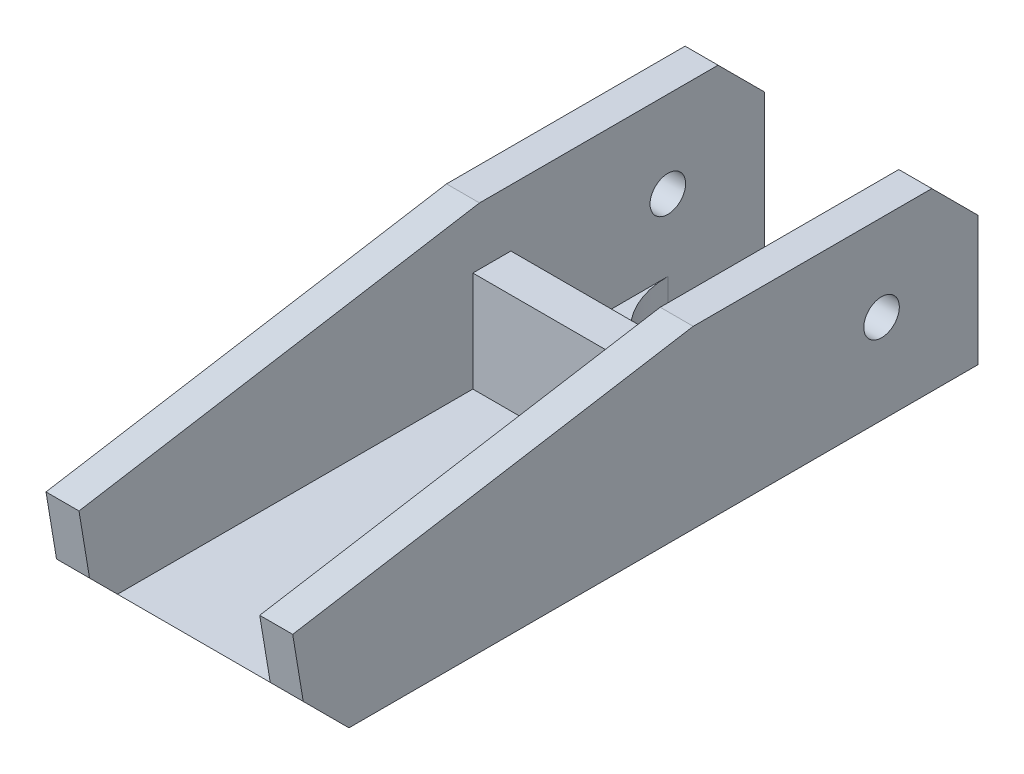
ISO-10303-21;
HEADER;
FILE_DESCRIPTION(('STEP AP214'),'2;1');
FILE_NAME('part.step','',(''),(''),'','','');
FILE_SCHEMA(('AUTOMOTIVE_DESIGN { 1 0 10303 214 1 1 1 1 }'));
ENDSEC;
DATA;
#1=APPLICATION_CONTEXT('core data for automotive mechanical design processes');
#2=APPLICATION_PROTOCOL_DEFINITION('international standard','automotive_design',2000,#1);
#3=PRODUCT_CONTEXT('',#1,'mechanical');
#4=PRODUCT('Part','Part','',(#3));
#5=PRODUCT_RELATED_PRODUCT_CATEGORY('part','',(#4));
#6=PRODUCT_DEFINITION_FORMATION('','',#4);
#7=PRODUCT_DEFINITION_CONTEXT('part definition',#1,'design');
#8=PRODUCT_DEFINITION('design','',#6,#7);
#9=PRODUCT_DEFINITION_SHAPE('','',#8);
#10=(LENGTH_UNIT() NAMED_UNIT(*) SI_UNIT(.MILLI.,.METRE.));
#11=(NAMED_UNIT(*) PLANE_ANGLE_UNIT() SI_UNIT($,.RADIAN.));
#12=(NAMED_UNIT(*) SI_UNIT($,.STERADIAN.) SOLID_ANGLE_UNIT());
#13=UNCERTAINTY_MEASURE_WITH_UNIT(LENGTH_MEASURE(1.E-05),#10,'distance_accuracy_value','');
#14=(GEOMETRIC_REPRESENTATION_CONTEXT(3) GLOBAL_UNCERTAINTY_ASSIGNED_CONTEXT((#13)) GLOBAL_UNIT_ASSIGNED_CONTEXT((#10,
#11,#12)) REPRESENTATION_CONTEXT('',''));
#15=CARTESIAN_POINT('',(0.,0.,0.));
#16=DIRECTION('',(0.,0.,1.));
#17=DIRECTION('',(1.,0.,0.));
#18=AXIS2_PLACEMENT_3D('',#15,#16,#17);
#19=CARTESIAN_POINT('',(8.9,5.9,0.));
#20=DIRECTION('',(0.,0.,1.));
#21=DIRECTION('',(1.,0.,0.));
#22=AXIS2_PLACEMENT_3D('',#19,#20,#21);
#23=PLANE('',#22);
#24=DIRECTION('',(1.,0.,0.));
#25=VECTOR('',#24,1.);
#26=CARTESIAN_POINT('',(8.9,-3.75,0.));
#27=LINE('',#26,#25);
#28=CARTESIAN_POINT('',(-1.25,-3.75,0.));
#29=VERTEX_POINT('',#28);
#30=CARTESIAN_POINT('',(0.,-3.75,0.));
#31=VERTEX_POINT('',#30);
#32=EDGE_CURVE('E318',#29,#31,#27,.T.);
#33=ORIENTED_EDGE('',*,*,#32,.F.);
#34=DIRECTION('',(-0.707106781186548,0.707106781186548,0.));
#35=VECTOR('',#34,1.);
#36=CARTESIAN_POINT('',(-1.25,-3.75,0.));
#37=LINE('',#36,#35);
#38=CARTESIAN_POINT('',(-3.25,-1.75,0.));
#39=VERTEX_POINT('',#38);
#40=EDGE_CURVE('E290',#29,#39,#37,.T.);
#41=ORIENTED_EDGE('',*,*,#40,.T.);
#42=DIRECTION('',(0.,1.,0.));
#43=VECTOR('',#42,1.);
#44=CARTESIAN_POINT('',(-3.25,5.9,0.));
#45=LINE('',#44,#43);
#46=CARTESIAN_POINT('',(-3.25,11.,0.));
#47=VERTEX_POINT('',#46);
#48=EDGE_CURVE('E341',#39,#47,#45,.T.);
#49=ORIENTED_EDGE('',*,*,#48,.T.);
#50=DIRECTION('',(1.,0.,0.));
#51=VECTOR('',#50,1.);
#52=CARTESIAN_POINT('',(-3.252,11.,0.));
#53=LINE('',#52,#51);
#54=CARTESIAN_POINT('',(0.,11.,0.));
#55=VERTEX_POINT('',#54);
#56=EDGE_CURVE('E339',#47,#55,#53,.T.);
#57=ORIENTED_EDGE('',*,*,#56,.T.);
#58=DIRECTION('',(0.,1.,0.));
#59=VECTOR('',#58,1.);
#60=CARTESIAN_POINT('',(0.,7.775,0.));
#61=LINE('',#60,#59);
#62=EDGE_CURVE('E256',#31,#55,#61,.T.);
#63=ORIENTED_EDGE('',*,*,#62,.F.);
#64=EDGE_LOOP('',(#33,#41,#49,#57,#63));
#65=FACE_BOUND('',#64,.T.);
#66=ADVANCED_FACE('F16',(#65),#23,.F.);
#67=CARTESIAN_POINT('',(8.9,-3.75,67.5));
#68=DIRECTION('',(0.,1.,0.));
#69=DIRECTION('',(0.,0.,1.));
#70=AXIS2_PLACEMENT_3D('',#67,#68,#69);
#71=PLANE('',#70);
#72=DIRECTION('',(1.,0.,0.));
#73=VECTOR('',#72,1.);
#74=CARTESIAN_POINT('',(-3.252,-3.75,59.9577189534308));
#75=LINE('',#74,#73);
#76=CARTESIAN_POINT('',(-1.25,-3.75,59.9577189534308));
#77=VERTEX_POINT('',#76);
#78=CARTESIAN_POINT('',(19.05,-3.75,59.9577189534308));
#79=VERTEX_POINT('',#78);
#80=EDGE_CURVE('E375',#77,#79,#75,.T.);
#81=ORIENTED_EDGE('',*,*,#80,.F.);
#82=DIRECTION('',(0.,0.,-1.));
#83=VECTOR('',#82,1.);
#84=CARTESIAN_POINT('',(-1.25,-3.75,0.));
#85=LINE('',#84,#83);
#86=EDGE_CURVE('E286',#77,#29,#85,.T.);
#87=ORIENTED_EDGE('',*,*,#86,.T.);
#88=ORIENTED_EDGE('',*,*,#32,.T.);
#89=DIRECTION('',(0.,0.,1.));
#90=VECTOR('',#89,1.);
#91=CARTESIAN_POINT('',(0.,-3.75,67.5));
#92=LINE('',#91,#90);
#93=CARTESIAN_POINT('',(0.,-3.75,9.5));
#94=VERTEX_POINT('',#93);
#95=EDGE_CURVE('E228',#31,#94,#92,.T.);
#96=ORIENTED_EDGE('',*,*,#95,.T.);
#97=CARTESIAN_POINT('',(8.9,-3.75,9.5));
#98=DIRECTION('',(0.,1.,0.));
#99=DIRECTION('',(0.,0.,1.));
#100=AXIS2_PLACEMENT_3D('',#97,#98,#99);
#101=CIRCLE('',#100,8.9);
#102=CARTESIAN_POINT('',(17.8,-3.75,9.5));
#103=VERTEX_POINT('',#102);
#104=EDGE_CURVE('E222',#103,#94,#101,.F.);
#105=ORIENTED_EDGE('',*,*,#104,.F.);
#106=DIRECTION('',(0.,0.,1.));
#107=VECTOR('',#106,1.);
#108=CARTESIAN_POINT('',(17.8,-3.75,67.5));
#109=LINE('',#108,#107);
#110=CARTESIAN_POINT('',(17.8,-3.75,0.));
#111=VERTEX_POINT('',#110);
#112=EDGE_CURVE('E498',#111,#103,#109,.T.);
#113=ORIENTED_EDGE('',*,*,#112,.F.);
#114=CARTESIAN_POINT('',(19.05,-3.75,0.));
#115=VERTEX_POINT('',#114);
#116=EDGE_CURVE('E325',#111,#115,#27,.T.);
#117=ORIENTED_EDGE('',*,*,#116,.T.);
#118=DIRECTION('',(0.,0.,1.));
#119=VECTOR('',#118,1.);
#120=CARTESIAN_POINT('',(19.05,-3.75,67.5));
#121=LINE('',#120,#119);
#122=EDGE_CURVE('E283',#115,#79,#121,.T.);
#123=ORIENTED_EDGE('',*,*,#122,.T.);
#124=EDGE_LOOP('',(#81,#87,#88,#96,#105,#113,#117,#123));
#125=FACE_BOUND('',#124,.T.);
#126=ADVANCED_FACE('F525',(#125),#71,.F.);
#127=CARTESIAN_POINT('',(8.9,0.,67.5));
#128=DIRECTION('',(0.,1.,0.));
#129=DIRECTION('',(0.,0.,1.));
#130=AXIS2_PLACEMENT_3D('',#127,#128,#129);
#131=PLANE('',#130);
#132=DIRECTION('',(0.,0.,-1.));
#133=VECTOR('',#132,1.);
#134=CARTESIAN_POINT('',(17.8,0.,67.5));
#135=LINE('',#134,#133);
#136=CARTESIAN_POINT('',(17.8,0.,63.7077189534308));
#137=VERTEX_POINT('',#136);
#138=CARTESIAN_POINT('',(17.8,0.,28.7077189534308));
#139=VERTEX_POINT('',#138);
#140=EDGE_CURVE('E260',#137,#139,#135,.T.);
#141=ORIENTED_EDGE('',*,*,#140,.T.);
#142=DIRECTION('',(-1.,0.,0.));
#143=VECTOR('',#142,1.);
#144=CARTESIAN_POINT('',(8.9,0.,28.7077189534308));
#145=LINE('',#144,#143);
#146=CARTESIAN_POINT('',(0.,0.,28.7077189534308));
#147=VERTEX_POINT('',#146);
#148=EDGE_CURVE('E494',#139,#147,#145,.T.);
#149=ORIENTED_EDGE('',*,*,#148,.T.);
#150=DIRECTION('',(0.,0.,-1.));
#151=VECTOR('',#150,1.);
#152=CARTESIAN_POINT('',(0.,0.,67.5));
#153=LINE('',#152,#151);
#154=CARTESIAN_POINT('',(0.,0.,63.7077189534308));
#155=VERTEX_POINT('',#154);
#156=EDGE_CURVE('E246',#155,#147,#153,.T.);
#157=ORIENTED_EDGE('',*,*,#156,.F.);
#158=DIRECTION('',(1.,0.,0.));
#159=VECTOR('',#158,1.);
#160=CARTESIAN_POINT('',(8.9,0.,63.7077189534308));
#161=LINE('',#160,#159);
#162=EDGE_CURVE('E381',#155,#137,#161,.T.);
#163=ORIENTED_EDGE('',*,*,#162,.T.);
#164=EDGE_LOOP('',(#141,#149,#157,#163));
#165=FACE_BOUND('',#164,.T.);
#166=ADVANCED_FACE('F617',(#165),#131,.T.);
#167=CARTESIAN_POINT('',(0.,7.775,67.5));
#168=DIRECTION('',(-1.,0.,0.));
#169=DIRECTION('',(0.,0.,1.));
#170=AXIS2_PLACEMENT_3D('',#167,#168,#169);
#171=PLANE('',#170);
#172=CARTESIAN_POINT('',(0.,7.05,9.5));
#173=DIRECTION('',(-1.,0.,0.));
#174=DIRECTION('',(0.,0.,1.));
#175=AXIS2_PLACEMENT_3D('',#172,#173,#174);
#176=CIRCLE('',#175,1.75);
#177=CARTESIAN_POINT('',(0.,7.05,11.25));
#178=VERTEX_POINT('',#177);
#179=EDGE_CURVE('E395',#178,#178,#176,.T.);
#180=ORIENTED_EDGE('',*,*,#179,.T.);
#181=EDGE_LOOP('',(#180));
#182=FACE_BOUND('',#181,.T.);
#183=DIRECTION('',(0.,-1.,0.));
#184=VECTOR('',#183,1.);
#185=CARTESIAN_POINT('',(0.,9.9,28.7077189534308));
#186=LINE('',#185,#184);
#187=CARTESIAN_POINT('',(0.,9.9,28.7077189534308));
#188=VERTEX_POINT('',#187);
#189=EDGE_CURVE('E486',#188,#147,#186,.T.);
#190=ORIENTED_EDGE('',*,*,#189,.F.);
#191=DIRECTION('',(0.,0.,-1.));
#192=VECTOR('',#191,1.);
#193=CARTESIAN_POINT('',(0.,9.9,67.5));
#194=LINE('',#193,#192);
#195=CARTESIAN_POINT('',(0.,9.9,24.9577189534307));
#196=VERTEX_POINT('',#195);
#197=EDGE_CURVE('E489',#188,#196,#194,.T.);
#198=ORIENTED_EDGE('',*,*,#197,.T.);
#199=DIRECTION('',(0.,-1.,0.));
#200=VECTOR('',#199,1.);
#201=CARTESIAN_POINT('',(0.,9.9,24.9577189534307));
#202=LINE('',#201,#200);
#203=CARTESIAN_POINT('',(0.,0.,24.9577189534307));
#204=VERTEX_POINT('',#203);
#205=EDGE_CURVE('E244',#196,#204,#202,.T.);
#206=ORIENTED_EDGE('',*,*,#205,.T.);
#207=CARTESIAN_POINT('',(0.,0.,9.5));
#208=VERTEX_POINT('',#207);
#209=EDGE_CURVE('E235',#204,#208,#153,.T.);
#210=ORIENTED_EDGE('',*,*,#209,.T.);
#211=DIRECTION('',(0.,1.,0.));
#212=VECTOR('',#211,1.);
#213=CARTESIAN_POINT('',(0.,-3.752,9.5));
#214=LINE('',#213,#212);
#215=EDGE_CURVE('E216',#94,#208,#214,.T.);
#216=ORIENTED_EDGE('',*,*,#215,.F.);
#217=ORIENTED_EDGE('',*,*,#95,.F.);
#218=ORIENTED_EDGE('',*,*,#62,.T.);
#219=DIRECTION('',(0.,0.707106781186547,0.707106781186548));
#220=VECTOR('',#219,1.);
#221=CARTESIAN_POINT('',(0.,43.1375,32.1375));
#222=LINE('',#221,#220);
#223=CARTESIAN_POINT('',(0.,15.55,4.55));
#224=VERTEX_POINT('',#223);
#225=EDGE_CURVE('E334',#55,#224,#222,.T.);
#226=ORIENTED_EDGE('',*,*,#225,.T.);
#227=DIRECTION('',(0.,0.,-1.));
#228=VECTOR('',#227,1.);
#229=CARTESIAN_POINT('',(0.,15.55,67.5));
#230=LINE('',#229,#228);
#231=CARTESIAN_POINT('',(0.,15.55,28.05));
#232=VERTEX_POINT('',#231);
#233=EDGE_CURVE('E247',#232,#224,#230,.T.);
#234=ORIENTED_EDGE('',*,*,#233,.F.);
#235=DIRECTION('',(0.,0.163790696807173,-0.986495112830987));
#236=VECTOR('',#235,1.);
#237=CARTESIAN_POINT('',(0.,8.96713644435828,67.6979339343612));
#238=LINE('',#237,#236);
#239=CARTESIAN_POINT('',(0.,9.,67.5));
#240=VERTEX_POINT('',#239);
#241=EDGE_CURVE('E280',#240,#232,#238,.T.);
#242=ORIENTED_EDGE('',*,*,#241,.F.);
#243=DIRECTION('',(0.,0.986495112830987,0.163790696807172));
#244=VECTOR('',#243,1.);
#245=CARTESIAN_POINT('',(0.,7.80786355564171,67.3020660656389));
#246=LINE('',#245,#244);
#247=CARTESIAN_POINT('',(0.,2.75548593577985,66.4632048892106));
#248=VERTEX_POINT('',#247);
#249=EDGE_CURVE('E450',#248,#240,#246,.T.);
#250=ORIENTED_EDGE('',*,*,#249,.F.);
#251=DIRECTION('',(0.,0.707106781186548,0.707106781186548));
#252=VECTOR('',#251,1.);
#253=CARTESIAN_POINT('',(0.,5.78364052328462,69.4913594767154));
#254=LINE('',#253,#252);
#255=EDGE_CURVE('E276',#155,#248,#254,.T.);
#256=ORIENTED_EDGE('',*,*,#255,.F.);
#257=ORIENTED_EDGE('',*,*,#156,.T.);
#258=EDGE_LOOP('',(#190,#198,#206,#210,#216,#217,#218,#226,#234,#242,#250,#256,#257));
#259=FACE_BOUND('',#258,.T.);
#260=ADVANCED_FACE('F242',(#182,#259),#171,.F.);
#261=CARTESIAN_POINT('',(-1.625,15.55,67.5));
#262=DIRECTION('',(0.,1.,0.));
#263=DIRECTION('',(0.,0.,1.));
#264=AXIS2_PLACEMENT_3D('',#261,#262,#263);
#265=PLANE('',#264);
#266=DIRECTION('',(0.,0.,-1.));
#267=VECTOR('',#266,1.);
#268=CARTESIAN_POINT('',(-3.25,15.55,67.5));
#269=LINE('',#268,#267);
#270=CARTESIAN_POINT('',(-3.25,15.55,28.05));
#271=VERTEX_POINT('',#270);
#272=CARTESIAN_POINT('',(-3.25,15.55,4.55));
#273=VERTEX_POINT('',#272);
#274=EDGE_CURVE('E272',#271,#273,#269,.T.);
#275=ORIENTED_EDGE('',*,*,#274,.F.);
#276=DIRECTION('',(1.,0.,0.));
#277=VECTOR('',#276,1.);
#278=CARTESIAN_POINT('',(-3.252,15.55,28.05));
#279=LINE('',#278,#277);
#280=EDGE_CURVE('E370',#271,#232,#279,.T.);
#281=ORIENTED_EDGE('',*,*,#280,.T.);
#282=ORIENTED_EDGE('',*,*,#233,.T.);
#283=DIRECTION('',(1.,0.,0.));
#284=VECTOR('',#283,1.);
#285=CARTESIAN_POINT('',(-3.252,15.55,4.55));
#286=LINE('',#285,#284);
#287=EDGE_CURVE('E346',#273,#224,#286,.T.);
#288=ORIENTED_EDGE('',*,*,#287,.F.);
#289=EDGE_LOOP('',(#275,#281,#282,#288));
#290=FACE_BOUND('',#289,.T.);
#291=ADVANCED_FACE('F415',(#290),#265,.T.);
#292=CARTESIAN_POINT('',(19.425,15.55,67.5));
#293=DIRECTION('',(0.,1.,0.));
#294=DIRECTION('',(0.,0.,1.));
#295=AXIS2_PLACEMENT_3D('',#292,#293,#294);
#296=PLANE('',#295);
#297=DIRECTION('',(0.,0.,-1.));
#298=VECTOR('',#297,1.);
#299=CARTESIAN_POINT('',(17.8,15.55,67.5));
#300=LINE('',#299,#298);
#301=CARTESIAN_POINT('',(17.8,15.55,28.05));
#302=VERTEX_POINT('',#301);
#303=CARTESIAN_POINT('',(17.8,15.55,4.55));
#304=VERTEX_POINT('',#303);
#305=EDGE_CURVE('E264',#302,#304,#300,.T.);
#306=ORIENTED_EDGE('',*,*,#305,.F.);
#307=CARTESIAN_POINT('',(21.05,15.55,28.05));
#308=VERTEX_POINT('',#307);
#309=EDGE_CURVE('E454',#302,#308,#279,.T.);
#310=ORIENTED_EDGE('',*,*,#309,.T.);
#311=DIRECTION('',(0.,0.,-1.));
#312=VECTOR('',#311,1.);
#313=CARTESIAN_POINT('',(21.05,15.55,67.5));
#314=LINE('',#313,#312);
#315=CARTESIAN_POINT('',(21.05,15.55,4.55));
#316=VERTEX_POINT('',#315);
#317=EDGE_CURVE('E268',#308,#316,#314,.T.);
#318=ORIENTED_EDGE('',*,*,#317,.T.);
#319=EDGE_CURVE('E355',#304,#316,#286,.T.);
#320=ORIENTED_EDGE('',*,*,#319,.F.);
#321=EDGE_LOOP('',(#306,#310,#318,#320));
#322=FACE_BOUND('',#321,.T.);
#323=ADVANCED_FACE('F410',(#322),#296,.T.);
#324=CARTESIAN_POINT('',(17.8,7.775,67.5));
#325=DIRECTION('',(-1.,0.,0.));
#326=DIRECTION('',(0.,-1.,0.));
#327=AXIS2_PLACEMENT_3D('',#324,#325,#326);
#328=PLANE('',#327);
#329=DIRECTION('',(0.,-1.,0.));
#330=VECTOR('',#329,1.);
#331=CARTESIAN_POINT('',(17.8,9.9,24.9577189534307));
#332=LINE('',#331,#330);
#333=CARTESIAN_POINT('',(17.8,9.9,24.9577189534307));
#334=VERTEX_POINT('',#333);
#335=CARTESIAN_POINT('',(17.8,0.,24.9577189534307));
#336=VERTEX_POINT('',#335);
#337=EDGE_CURVE('E481',#334,#336,#332,.T.);
#338=ORIENTED_EDGE('',*,*,#337,.F.);
#339=DIRECTION('',(0.,0.,-1.));
#340=VECTOR('',#339,1.);
#341=CARTESIAN_POINT('',(17.8,9.9,67.5));
#342=LINE('',#341,#340);
#343=CARTESIAN_POINT('',(17.8,9.9,28.7077189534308));
#344=VERTEX_POINT('',#343);
#345=EDGE_CURVE('E505',#344,#334,#342,.T.);
#346=ORIENTED_EDGE('',*,*,#345,.F.);
#347=DIRECTION('',(0.,-1.,0.));
#348=VECTOR('',#347,1.);
#349=CARTESIAN_POINT('',(17.8,9.9,28.7077189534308));
#350=LINE('',#349,#348);
#351=EDGE_CURVE('E437',#344,#139,#350,.T.);
#352=ORIENTED_EDGE('',*,*,#351,.T.);
#353=ORIENTED_EDGE('',*,*,#140,.F.);
#354=DIRECTION('',(0.,0.707106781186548,0.707106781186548));
#355=VECTOR('',#354,1.);
#356=CARTESIAN_POINT('',(17.8,5.78364052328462,69.4913594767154));
#357=LINE('',#356,#355);
#358=CARTESIAN_POINT('',(17.8,2.75548593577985,66.4632048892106));
#359=VERTEX_POINT('',#358);
#360=EDGE_CURVE('E378',#137,#359,#357,.T.);
#361=ORIENTED_EDGE('',*,*,#360,.T.);
#362=DIRECTION('',(0.,0.986495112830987,0.163790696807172));
#363=VECTOR('',#362,1.);
#364=CARTESIAN_POINT('',(17.8,7.80786355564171,67.3020660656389));
#365=LINE('',#364,#363);
#366=CARTESIAN_POINT('',(17.8,9.,67.5));
#367=VERTEX_POINT('',#366);
#368=EDGE_CURVE('E388',#359,#367,#365,.T.);
#369=ORIENTED_EDGE('',*,*,#368,.T.);
#370=DIRECTION('',(0.,0.163790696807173,-0.986495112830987));
#371=VECTOR('',#370,1.);
#372=CARTESIAN_POINT('',(17.8,8.96713644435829,67.6979339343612));
#373=LINE('',#372,#371);
#374=EDGE_CURVE('E394',#367,#302,#373,.T.);
#375=ORIENTED_EDGE('',*,*,#374,.T.);
#376=ORIENTED_EDGE('',*,*,#305,.T.);
#377=DIRECTION('',(0.,0.707106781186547,0.707106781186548));
#378=VECTOR('',#377,1.);
#379=CARTESIAN_POINT('',(17.8,43.1375,32.1375));
#380=LINE('',#379,#378);
#381=CARTESIAN_POINT('',(17.8,11.,0.));
#382=VERTEX_POINT('',#381);
#383=EDGE_CURVE('E399',#382,#304,#380,.T.);
#384=ORIENTED_EDGE('',*,*,#383,.F.);
#385=DIRECTION('',(0.,1.,0.));
#386=VECTOR('',#385,1.);
#387=CARTESIAN_POINT('',(17.8,7.775,0.));
#388=LINE('',#387,#386);
#389=EDGE_CURVE('E317',#111,#382,#388,.T.);
#390=ORIENTED_EDGE('',*,*,#389,.F.);
#391=ORIENTED_EDGE('',*,*,#112,.T.);
#392=DIRECTION('',(0.,1.,0.));
#393=VECTOR('',#392,1.);
#394=CARTESIAN_POINT('',(17.8,-3.752,9.5));
#395=LINE('',#394,#393);
#396=CARTESIAN_POINT('',(17.8,0.,9.5));
#397=VERTEX_POINT('',#396);
#398=EDGE_CURVE('E229',#103,#397,#395,.T.);
#399=ORIENTED_EDGE('',*,*,#398,.T.);
#400=EDGE_CURVE('E237',#336,#397,#135,.T.);
#401=ORIENTED_EDGE('',*,*,#400,.F.);
#402=EDGE_LOOP('',(#338,#346,#352,#353,#361,#369,#375,#376,#384,#390,#391,#399,#401));
#403=FACE_BOUND('',#402,.T.);
#404=CARTESIAN_POINT('',(17.8,7.05,9.5));
#405=DIRECTION('',(-1.,0.,0.));
#406=DIRECTION('',(0.,-1.,0.));
#407=AXIS2_PLACEMENT_3D('',#404,#405,#406);
#408=CIRCLE('',#407,1.75);
#409=CARTESIAN_POINT('',(17.8,5.3,9.5));
#410=VERTEX_POINT('',#409);
#411=EDGE_CURVE('E390',#410,#410,#408,.T.);
#412=ORIENTED_EDGE('',*,*,#411,.F.);
#413=EDGE_LOOP('',(#412));
#414=FACE_BOUND('',#413,.T.);
#415=ADVANCED_FACE('F414',(#403,#414),#328,.T.);
#416=CARTESIAN_POINT('',(-3.25,5.9,67.5));
#417=DIRECTION('',(-1.,0.,0.));
#418=DIRECTION('',(0.,-1.,0.));
#419=AXIS2_PLACEMENT_3D('',#416,#417,#418);
#420=PLANE('',#419);
#421=ORIENTED_EDGE('',*,*,#48,.F.);
#422=DIRECTION('',(0.,0.,1.));
#423=VECTOR('',#422,1.);
#424=CARTESIAN_POINT('',(-3.25,-1.75,59.9577189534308));
#425=LINE('',#424,#423);
#426=CARTESIAN_POINT('',(-3.25,-1.75,61.9577189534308));
#427=VERTEX_POINT('',#426);
#428=EDGE_CURVE('E293',#39,#427,#425,.T.);
#429=ORIENTED_EDGE('',*,*,#428,.T.);
#430=DIRECTION('',(0.,-0.707106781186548,-0.707106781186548));
#431=VECTOR('',#430,1.);
#432=CARTESIAN_POINT('',(-3.25,-0.497257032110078,63.2104619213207));
#433=LINE('',#432,#431);
#434=CARTESIAN_POINT('',(-3.25,2.75548593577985,66.4632048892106));
#435=VERTEX_POINT('',#434);
#436=EDGE_CURVE('E445',#435,#427,#433,.T.);
#437=ORIENTED_EDGE('',*,*,#436,.F.);
#438=DIRECTION('',(0.,-0.986495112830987,-0.163790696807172));
#439=VECTOR('',#438,1.);
#440=CARTESIAN_POINT('',(-3.25,5.87774296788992,66.9816024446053));
#441=LINE('',#440,#439);
#442=CARTESIAN_POINT('',(-3.25,9.,67.5));
#443=VERTEX_POINT('',#442);
#444=EDGE_CURVE('E376',#443,#435,#441,.T.);
#445=ORIENTED_EDGE('',*,*,#444,.F.);
#446=DIRECTION('',(0.,-0.163790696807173,0.986495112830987));
#447=VECTOR('',#446,1.);
#448=CARTESIAN_POINT('',(-3.25,12.275,47.775));
#449=LINE('',#448,#447);
#450=EDGE_CURVE('E352',#271,#443,#449,.T.);
#451=ORIENTED_EDGE('',*,*,#450,.F.);
#452=ORIENTED_EDGE('',*,*,#274,.T.);
#453=DIRECTION('',(0.,-0.707106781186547,-0.707106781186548));
#454=VECTOR('',#453,1.);
#455=CARTESIAN_POINT('',(-3.25,13.275,2.275));
#456=LINE('',#455,#454);
#457=EDGE_CURVE('E365',#273,#47,#456,.T.);
#458=ORIENTED_EDGE('',*,*,#457,.T.);
#459=EDGE_LOOP('',(#421,#429,#437,#445,#451,#452,#458));
#460=FACE_BOUND('',#459,.T.);
#461=CARTESIAN_POINT('',(-3.25,7.05,9.5));
#462=DIRECTION('',(-1.,0.,0.));
#463=DIRECTION('',(0.,-1.,0.));
#464=AXIS2_PLACEMENT_3D('',#461,#462,#463);
#465=CIRCLE('',#464,1.75);
#466=CARTESIAN_POINT('',(-3.25,5.3,9.5));
#467=VERTEX_POINT('',#466);
#468=EDGE_CURVE('E432',#467,#467,#465,.F.);
#469=ORIENTED_EDGE('',*,*,#468,.T.);
#470=EDGE_LOOP('',(#469));
#471=FACE_BOUND('',#470,.T.);
#472=ADVANCED_FACE('F531',(#460,#471),#420,.T.);
#473=CARTESIAN_POINT('',(21.05,5.9,67.5));
#474=DIRECTION('',(-1.,0.,0.));
#475=DIRECTION('',(0.,-1.,0.));
#476=AXIS2_PLACEMENT_3D('',#473,#474,#475);
#477=PLANE('',#476);
#478=CARTESIAN_POINT('',(21.05,7.05,9.5));
#479=DIRECTION('',(1.,0.,0.));
#480=DIRECTION('',(0.,1.,0.));
#481=AXIS2_PLACEMENT_3D('',#478,#479,#480);
#482=CIRCLE('',#481,1.75);
#483=CARTESIAN_POINT('',(21.05,8.8,9.5));
#484=VERTEX_POINT('',#483);
#485=EDGE_CURVE('E436',#484,#484,#482,.T.);
#486=ORIENTED_EDGE('',*,*,#485,.F.);
#487=EDGE_LOOP('',(#486));
#488=FACE_BOUND('',#487,.T.);
#489=DIRECTION('',(0.,-0.707106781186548,-0.707106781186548));
#490=VECTOR('',#489,1.);
#491=CARTESIAN_POINT('',(21.05,-0.497257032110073,63.2104619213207));
#492=LINE('',#491,#490);
#493=CARTESIAN_POINT('',(21.05,2.75548593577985,66.4632048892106));
#494=VERTEX_POINT('',#493);
#495=CARTESIAN_POINT('',(21.05,-1.75,61.9577189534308));
#496=VERTEX_POINT('',#495);
#497=EDGE_CURVE('E309',#494,#496,#492,.T.);
#498=ORIENTED_EDGE('',*,*,#497,.T.);
#499=DIRECTION('',(0.,0.,-1.));
#500=VECTOR('',#499,1.);
#501=CARTESIAN_POINT('',(21.05,-1.75,67.5));
#502=LINE('',#501,#500);
#503=CARTESIAN_POINT('',(21.05,-1.75,0.));
#504=VERTEX_POINT('',#503);
#505=EDGE_CURVE('E26',#496,#504,#502,.T.);
#506=ORIENTED_EDGE('',*,*,#505,.T.);
#507=DIRECTION('',(0.,1.,0.));
#508=VECTOR('',#507,1.);
#509=CARTESIAN_POINT('',(21.05,5.9,0.));
#510=LINE('',#509,#508);
#511=CARTESIAN_POINT('',(21.05,11.,0.));
#512=VERTEX_POINT('',#511);
#513=EDGE_CURVE('E306',#504,#512,#510,.T.);
#514=ORIENTED_EDGE('',*,*,#513,.T.);
#515=DIRECTION('',(0.,-0.707106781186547,-0.707106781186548));
#516=VECTOR('',#515,1.);
#517=CARTESIAN_POINT('',(21.05,13.275,2.275));
#518=LINE('',#517,#516);
#519=EDGE_CURVE('E345',#316,#512,#518,.T.);
#520=ORIENTED_EDGE('',*,*,#519,.F.);
#521=ORIENTED_EDGE('',*,*,#317,.F.);
#522=DIRECTION('',(0.,-0.163790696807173,0.986495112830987));
#523=VECTOR('',#522,1.);
#524=CARTESIAN_POINT('',(21.05,12.275,47.775));
#525=LINE('',#524,#523);
#526=CARTESIAN_POINT('',(21.05,9.,67.5));
#527=VERTEX_POINT('',#526);
#528=EDGE_CURVE('E369',#308,#527,#525,.T.);
#529=ORIENTED_EDGE('',*,*,#528,.T.);
#530=DIRECTION('',(0.,-0.986495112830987,-0.163790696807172));
#531=VECTOR('',#530,1.);
#532=CARTESIAN_POINT('',(21.05,5.87774296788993,66.9816024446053));
#533=LINE('',#532,#531);
#534=EDGE_CURVE('E447',#527,#494,#533,.T.);
#535=ORIENTED_EDGE('',*,*,#534,.T.);
#536=EDGE_LOOP('',(#498,#506,#514,#520,#521,#529,#535));
#537=FACE_BOUND('',#536,.T.);
#538=ADVANCED_FACE('F304',(#488,#537),#477,.F.);
#539=CARTESIAN_POINT('',(8.9,0.,9.5));
#540=DIRECTION('',(0.,1.,0.));
#541=DIRECTION('',(0.,0.,1.));
#542=AXIS2_PLACEMENT_3D('',#539,#540,#541);
#543=CIRCLE('',#542,8.9);
#544=EDGE_CURVE('E219',#208,#397,#543,.T.);
#545=ORIENTED_EDGE('',*,*,#544,.F.);
#546=ORIENTED_EDGE('',*,*,#209,.F.);
#547=DIRECTION('',(-1.,0.,0.));
#548=VECTOR('',#547,1.);
#549=CARTESIAN_POINT('',(8.9,0.,24.9577189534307));
#550=LINE('',#549,#548);
#551=EDGE_CURVE('E490',#336,#204,#550,.T.);
#552=ORIENTED_EDGE('',*,*,#551,.F.);
#553=ORIENTED_EDGE('',*,*,#400,.T.);
#554=EDGE_LOOP('',(#545,#546,#552,#553));
#555=FACE_BOUND('',#554,.T.);
#556=ADVANCED_FACE('F233',(#555),#131,.T.);
#557=ORIENTED_EDGE('',*,*,#513,.F.);
#558=DIRECTION('',(0.707106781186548,0.707106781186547,0.));
#559=VECTOR('',#558,1.);
#560=CARTESIAN_POINT('',(21.05,-1.75,0.));
#561=LINE('',#560,#559);
#562=EDGE_CURVE('E10',#504,#115,#561,.F.);
#563=ORIENTED_EDGE('',*,*,#562,.T.);
#564=ORIENTED_EDGE('',*,*,#116,.F.);
#565=ORIENTED_EDGE('',*,*,#389,.T.);
#566=EDGE_CURVE('E279',#382,#512,#53,.T.);
#567=ORIENTED_EDGE('',*,*,#566,.T.);
#568=EDGE_LOOP('',(#557,#563,#564,#565,#567));
#569=FACE_BOUND('',#568,.T.);
#570=ADVANCED_FACE('F312',(#569),#23,.F.);
#571=CARTESIAN_POINT('',(-3.252,5.87774296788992,66.9816024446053));
#572=DIRECTION('',(0.,-0.163790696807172,0.986495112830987));
#573=DIRECTION('',(0.,-0.986495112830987,-0.163790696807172));
#574=AXIS2_PLACEMENT_3D('',#571,#572,#573);
#575=PLANE('',#574);
#576=ORIENTED_EDGE('',*,*,#249,.T.);
#577=DIRECTION('',(1.,0.,0.));
#578=VECTOR('',#577,1.);
#579=CARTESIAN_POINT('',(-3.252,9.,67.5));
#580=LINE('',#579,#578);
#581=EDGE_CURVE('E372',#443,#240,#580,.T.);
#582=ORIENTED_EDGE('',*,*,#581,.F.);
#583=ORIENTED_EDGE('',*,*,#444,.T.);
#584=DIRECTION('',(1.,0.,0.));
#585=VECTOR('',#584,1.);
#586=CARTESIAN_POINT('',(-3.252,2.75548593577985,66.4632048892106));
#587=LINE('',#586,#585);
#588=EDGE_CURVE('E545',#435,#248,#587,.T.);
#589=ORIENTED_EDGE('',*,*,#588,.T.);
#590=EDGE_LOOP('',(#576,#582,#583,#589));
#591=FACE_BOUND('',#590,.T.);
#592=ADVANCED_FACE('F660',(#591),#575,.T.);
#593=EDGE_CURVE('E549',#359,#494,#587,.T.);
#594=ORIENTED_EDGE('',*,*,#593,.T.);
#595=ORIENTED_EDGE('',*,*,#534,.F.);
#596=DIRECTION('',(1.,0.,0.));
#597=VECTOR('',#596,1.);
#598=CARTESIAN_POINT('',(-3.252,9.,67.5));
#599=LINE('',#598,#597);
#600=EDGE_CURVE('E366',#367,#527,#599,.T.);
#601=ORIENTED_EDGE('',*,*,#600,.F.);
#602=ORIENTED_EDGE('',*,*,#368,.F.);
#603=EDGE_LOOP('',(#594,#595,#601,#602));
#604=FACE_BOUND('',#603,.T.);
#605=ADVANCED_FACE('F667',(#604),#575,.T.);
#606=CARTESIAN_POINT('',(-3.252,-0.497257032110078,63.2104619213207));
#607=DIRECTION('',(0.,-0.707106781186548,0.707106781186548));
#608=DIRECTION('',(0.,-0.707106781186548,-0.707106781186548));
#609=AXIS2_PLACEMENT_3D('',#606,#607,#608);
#610=PLANE('',#609);
#611=ORIENTED_EDGE('',*,*,#436,.T.);
#612=DIRECTION('',(0.577350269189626,-0.577350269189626,-0.577350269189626));
#613=VECTOR('',#612,1.);
#614=CARTESIAN_POINT('',(-4.08582864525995,-0.914171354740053,62.7935475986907));
#615=LINE('',#614,#613);
#616=EDGE_CURVE('E298',#427,#77,#615,.T.);
#617=ORIENTED_EDGE('',*,*,#616,.T.);
#618=ORIENTED_EDGE('',*,*,#80,.T.);
#619=DIRECTION('',(-0.577350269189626,-0.577350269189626,-0.577350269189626));
#620=VECTOR('',#619,1.);
#621=CARTESIAN_POINT('',(13.7844953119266,-9.01550468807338,54.6922142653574));
#622=LINE('',#621,#620);
#623=EDGE_CURVE('E47',#79,#496,#622,.F.);
#624=ORIENTED_EDGE('',*,*,#623,.T.);
#625=ORIENTED_EDGE('',*,*,#497,.F.);
#626=ORIENTED_EDGE('',*,*,#593,.F.);
#627=ORIENTED_EDGE('',*,*,#360,.F.);
#628=ORIENTED_EDGE('',*,*,#162,.F.);
#629=ORIENTED_EDGE('',*,*,#255,.T.);
#630=ORIENTED_EDGE('',*,*,#588,.F.);
#631=EDGE_LOOP('',(#611,#617,#618,#624,#625,#626,#627,#628,#629,#630));
#632=FACE_BOUND('',#631,.T.);
#633=ADVANCED_FACE('F675',(#632),#610,.T.);
#634=CARTESIAN_POINT('',(-3.252,7.05,9.5));
#635=DIRECTION('',(1.,0.,0.));
#636=DIRECTION('',(0.,1.,0.));
#637=AXIS2_PLACEMENT_3D('',#634,#635,#636);
#638=CYLINDRICAL_SURFACE('',#637,1.75);
#639=ORIENTED_EDGE('',*,*,#411,.T.);
#640=EDGE_LOOP('',(#639));
#641=FACE_BOUND('',#640,.T.);
#642=ORIENTED_EDGE('',*,*,#485,.T.);
#643=EDGE_LOOP('',(#642));
#644=FACE_BOUND('',#643,.T.);
#645=ADVANCED_FACE('F682',(#641,#644),#638,.F.);
#646=ORIENTED_EDGE('',*,*,#468,.F.);
#647=EDGE_LOOP('',(#646));
#648=FACE_BOUND('',#647,.T.);
#649=ORIENTED_EDGE('',*,*,#179,.F.);
#650=EDGE_LOOP('',(#649));
#651=FACE_BOUND('',#650,.T.);
#652=ADVANCED_FACE('F689',(#648,#651),#638,.F.);
#653=CARTESIAN_POINT('',(-3.252,13.275,2.275));
#654=DIRECTION('',(0.,-0.707106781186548,0.707106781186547));
#655=DIRECTION('',(0.,-0.707106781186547,-0.707106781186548));
#656=AXIS2_PLACEMENT_3D('',#653,#654,#655);
#657=PLANE('',#656);
#658=ORIENTED_EDGE('',*,*,#56,.F.);
#659=ORIENTED_EDGE('',*,*,#457,.F.);
#660=ORIENTED_EDGE('',*,*,#287,.T.);
#661=ORIENTED_EDGE('',*,*,#225,.F.);
#662=EDGE_LOOP('',(#658,#659,#660,#661));
#663=FACE_BOUND('',#662,.T.);
#664=ADVANCED_FACE('F696',(#663),#657,.F.);
#665=CARTESIAN_POINT('',(-3.252,12.275,47.775));
#666=DIRECTION('',(0.,0.986495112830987,0.163790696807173));
#667=DIRECTION('',(0.,-0.163790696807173,0.986495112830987));
#668=AXIS2_PLACEMENT_3D('',#665,#666,#667);
#669=PLANE('',#668);
#670=ORIENTED_EDGE('',*,*,#241,.T.);
#671=ORIENTED_EDGE('',*,*,#280,.F.);
#672=ORIENTED_EDGE('',*,*,#450,.T.);
#673=ORIENTED_EDGE('',*,*,#581,.T.);
#674=EDGE_LOOP('',(#670,#671,#672,#673));
#675=FACE_BOUND('',#674,.T.);
#676=ADVANCED_FACE('F702',(#675),#669,.T.);
#677=ORIENTED_EDGE('',*,*,#383,.T.);
#678=ORIENTED_EDGE('',*,*,#319,.T.);
#679=ORIENTED_EDGE('',*,*,#519,.T.);
#680=ORIENTED_EDGE('',*,*,#566,.F.);
#681=EDGE_LOOP('',(#677,#678,#679,#680));
#682=FACE_BOUND('',#681,.T.);
#683=ADVANCED_FACE('F704',(#682),#657,.F.);
#684=ORIENTED_EDGE('',*,*,#600,.T.);
#685=ORIENTED_EDGE('',*,*,#528,.F.);
#686=ORIENTED_EDGE('',*,*,#309,.F.);
#687=ORIENTED_EDGE('',*,*,#374,.F.);
#688=EDGE_LOOP('',(#684,#685,#686,#687));
#689=FACE_BOUND('',#688,.T.);
#690=ADVANCED_FACE('F575',(#689),#669,.T.);
#691=CARTESIAN_POINT('',(8.9,9.9,28.7077189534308));
#692=DIRECTION('',(0.,0.,1.));
#693=DIRECTION('',(1.,0.,0.));
#694=AXIS2_PLACEMENT_3D('',#691,#692,#693);
#695=PLANE('',#694);
#696=ORIENTED_EDGE('',*,*,#148,.F.);
#697=ORIENTED_EDGE('',*,*,#351,.F.);
#698=DIRECTION('',(-1.,0.,0.));
#699=VECTOR('',#698,1.);
#700=CARTESIAN_POINT('',(8.9,9.9,28.7077189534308));
#701=LINE('',#700,#699);
#702=EDGE_CURVE('E493',#344,#188,#701,.T.);
#703=ORIENTED_EDGE('',*,*,#702,.T.);
#704=ORIENTED_EDGE('',*,*,#189,.T.);
#705=EDGE_LOOP('',(#696,#697,#703,#704));
#706=FACE_BOUND('',#705,.T.);
#707=ADVANCED_FACE('F570',(#706),#695,.T.);
#708=CARTESIAN_POINT('',(8.9,9.9,24.9577189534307));
#709=DIRECTION('',(0.,0.,1.));
#710=DIRECTION('',(1.,0.,0.));
#711=AXIS2_PLACEMENT_3D('',#708,#709,#710);
#712=PLANE('',#711);
#713=ORIENTED_EDGE('',*,*,#551,.T.);
#714=ORIENTED_EDGE('',*,*,#205,.F.);
#715=DIRECTION('',(-1.,0.,0.));
#716=VECTOR('',#715,1.);
#717=CARTESIAN_POINT('',(8.9,9.9,24.9577189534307));
#718=LINE('',#717,#716);
#719=EDGE_CURVE('E501',#334,#196,#718,.T.);
#720=ORIENTED_EDGE('',*,*,#719,.F.);
#721=ORIENTED_EDGE('',*,*,#337,.T.);
#722=EDGE_LOOP('',(#713,#714,#720,#721));
#723=FACE_BOUND('',#722,.T.);
#724=ADVANCED_FACE('F574',(#723),#712,.F.);
#725=CARTESIAN_POINT('',(8.9,9.9,31.8538594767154));
#726=DIRECTION('',(0.,1.,0.));
#727=DIRECTION('',(-1.,0.,0.));
#728=AXIS2_PLACEMENT_3D('',#725,#726,#727);
#729=PLANE('',#728);
#730=ORIENTED_EDGE('',*,*,#702,.F.);
#731=ORIENTED_EDGE('',*,*,#345,.T.);
#732=ORIENTED_EDGE('',*,*,#719,.T.);
#733=ORIENTED_EDGE('',*,*,#197,.F.);
#734=EDGE_LOOP('',(#730,#731,#732,#733));
#735=FACE_BOUND('',#734,.T.);
#736=ADVANCED_FACE('F583',(#735),#729,.T.);
#737=CARTESIAN_POINT('',(8.9,-3.752,9.5));
#738=DIRECTION('',(0.,1.,0.));
#739=DIRECTION('',(0.,0.,1.));
#740=AXIS2_PLACEMENT_3D('',#737,#738,#739);
#741=CYLINDRICAL_SURFACE('',#740,8.9);
#742=ORIENTED_EDGE('',*,*,#104,.T.);
#743=ORIENTED_EDGE('',*,*,#215,.T.);
#744=ORIENTED_EDGE('',*,*,#544,.T.);
#745=ORIENTED_EDGE('',*,*,#398,.F.);
#746=EDGE_LOOP('',(#742,#743,#744,#745));
#747=FACE_BOUND('',#746,.T.);
#748=ADVANCED_FACE('F218',(#747),#741,.F.);
#749=CARTESIAN_POINT('',(-1.25,-3.75,67.5));
#750=DIRECTION('',(-0.707106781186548,-0.707106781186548,0.));
#751=DIRECTION('',(0.,0.,1.));
#752=AXIS2_PLACEMENT_3D('',#749,#750,#751);
#753=PLANE('',#752);
#754=ORIENTED_EDGE('',*,*,#616,.F.);
#755=ORIENTED_EDGE('',*,*,#428,.F.);
#756=ORIENTED_EDGE('',*,*,#40,.F.);
#757=ORIENTED_EDGE('',*,*,#86,.F.);
#758=EDGE_LOOP('',(#754,#755,#756,#757));
#759=FACE_BOUND('',#758,.T.);
#760=ADVANCED_FACE('F529',(#759),#753,.T.);
#761=CARTESIAN_POINT('',(21.05,-1.75,67.5));
#762=DIRECTION('',(-0.707106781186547,0.707106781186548,0.));
#763=DIRECTION('',(0.,0.,-1.));
#764=AXIS2_PLACEMENT_3D('',#761,#762,#763);
#765=PLANE('',#764);
#766=ORIENTED_EDGE('',*,*,#623,.F.);
#767=ORIENTED_EDGE('',*,*,#122,.F.);
#768=ORIENTED_EDGE('',*,*,#562,.F.);
#769=ORIENTED_EDGE('',*,*,#505,.F.);
#770=EDGE_LOOP('',(#766,#767,#768,#769));
#771=FACE_BOUND('',#770,.T.);
#772=ADVANCED_FACE('F19',(#771),#765,.F.);
#773=CLOSED_SHELL('',(#66,#126,#166,#260,#291,#323,#415,#472,#538,#556,#570,#592,#605,#633,#645,
#652,#664,#676,#683,#690,#707,#724,#736,#748,#760,#772));
#774=MANIFOLD_SOLID_BREP('B1',#773);
#775=ADVANCED_BREP_SHAPE_REPRESENTATION('',(#18,#774),#14);
#776=SHAPE_DEFINITION_REPRESENTATION(#9,#775);
ENDSEC;
END-ISO-10303-21;
